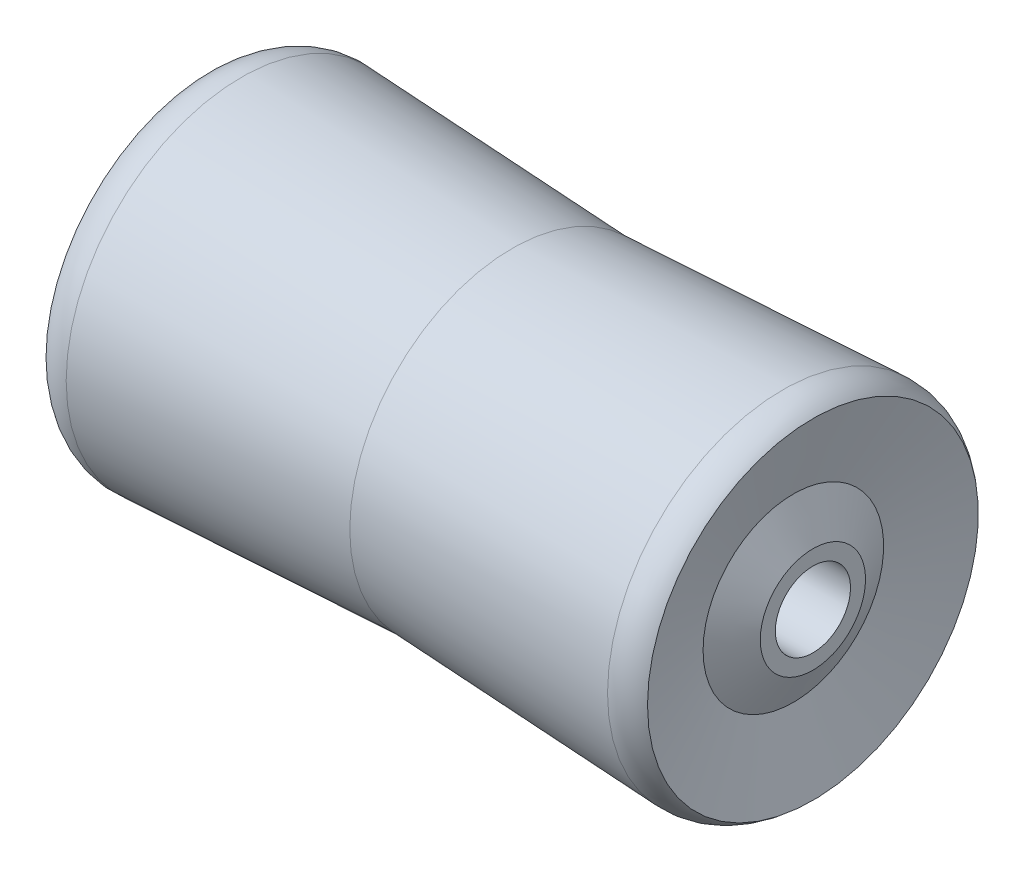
ISO-10303-21;
HEADER;
FILE_DESCRIPTION(('STEP AP214'),'2;1');
FILE_NAME('part.step','',(''),(''),'','','');
FILE_SCHEMA(('AUTOMOTIVE_DESIGN { 1 0 10303 214 1 1 1 1 }'));
ENDSEC;
DATA;
#1=APPLICATION_CONTEXT('core data for automotive mechanical design processes');
#2=APPLICATION_PROTOCOL_DEFINITION('international standard','automotive_design',2000,#1);
#3=PRODUCT_CONTEXT('',#1,'mechanical');
#4=PRODUCT('Part','Part','',(#3));
#5=PRODUCT_RELATED_PRODUCT_CATEGORY('part','',(#4));
#6=PRODUCT_DEFINITION_FORMATION('','',#4);
#7=PRODUCT_DEFINITION_CONTEXT('part definition',#1,'design');
#8=PRODUCT_DEFINITION('design','',#6,#7);
#9=PRODUCT_DEFINITION_SHAPE('','',#8);
#10=(LENGTH_UNIT() NAMED_UNIT(*) SI_UNIT(.MILLI.,.METRE.));
#11=(NAMED_UNIT(*) PLANE_ANGLE_UNIT() SI_UNIT($,.RADIAN.));
#12=(NAMED_UNIT(*) SI_UNIT($,.STERADIAN.) SOLID_ANGLE_UNIT());
#13=UNCERTAINTY_MEASURE_WITH_UNIT(LENGTH_MEASURE(1.E-05),#10,'distance_accuracy_value','');
#14=(GEOMETRIC_REPRESENTATION_CONTEXT(3) GLOBAL_UNCERTAINTY_ASSIGNED_CONTEXT((#13)) GLOBAL_UNIT_ASSIGNED_CONTEXT((#10,
#11,#12)) REPRESENTATION_CONTEXT('',''));
#15=CARTESIAN_POINT('',(0.,0.,0.));
#16=DIRECTION('',(0.,0.,1.));
#17=DIRECTION('',(1.,0.,0.));
#18=AXIS2_PLACEMENT_3D('',#15,#16,#17);
#19=CARTESIAN_POINT('',(-91.2203611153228,0.,0.));
#20=DIRECTION('',(-1.,0.,0.));
#21=DIRECTION('',(0.,0.,1.));
#22=AXIS2_PLACEMENT_3D('',#19,#20,#21);
#23=TOROIDAL_SURFACE('',#22,45.1735637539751,13.1772875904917);
#24=CARTESIAN_POINT('',(-89.9999999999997,0.,0.));
#25=DIRECTION('',(-1.,0.,0.));
#26=DIRECTION('',(0.,0.,1.));
#27=AXIS2_PLACEMENT_3D('',#24,#25,#26);
#28=CIRCLE('',#27,58.2942202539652);
#29=CARTESIAN_POINT('',(-89.9999999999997,0.,58.2942202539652));
#30=VERTEX_POINT('',#29);
#31=EDGE_CURVE('E65',#30,#30,#28,.T.);
#32=ORIENTED_EDGE('',*,*,#31,.T.);
#33=EDGE_LOOP('',(#32));
#34=FACE_BOUND('',#33,.T.);
#35=CARTESIAN_POINT('',(-100.,0.,0.));
#36=DIRECTION('',(-1.,0.,0.));
#37=DIRECTION('',(0.,0.,1.));
#38=AXIS2_PLACEMENT_3D('',#35,#36,#37);
#39=CIRCLE('',#38,55.);
#40=CARTESIAN_POINT('',(-100.,0.,55.));
#41=VERTEX_POINT('',#40);
#42=EDGE_CURVE('E10',#41,#41,#39,.T.);
#43=ORIENTED_EDGE('',*,*,#42,.F.);
#44=EDGE_LOOP('',(#43));
#45=FACE_BOUND('',#44,.T.);
#46=ADVANCED_FACE('F28',(#34,#45),#23,.T.);
#47=CARTESIAN_POINT('',(-100.,0.,0.));
#48=DIRECTION('',(-1.,0.,0.));
#49=DIRECTION('',(0.,0.,1.));
#50=AXIS2_PLACEMENT_3D('',#47,#48,#49);
#51=CONICAL_SURFACE('',#50,55.,1.31623218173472);
#52=CARTESIAN_POINT('',(-93.5,0.,0.));
#53=DIRECTION('',(-1.,0.,0.));
#54=DIRECTION('',(0.,0.,1.));
#55=AXIS2_PLACEMENT_3D('',#52,#53,#54);
#56=CIRCLE('',#55,30.0201138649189);
#57=CARTESIAN_POINT('',(-93.5,0.,30.0201138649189));
#58=VERTEX_POINT('',#57);
#59=EDGE_CURVE('E34',#58,#58,#56,.T.);
#60=ORIENTED_EDGE('',*,*,#59,.F.);
#61=EDGE_LOOP('',(#60));
#62=FACE_BOUND('',#61,.T.);
#63=ORIENTED_EDGE('',*,*,#42,.T.);
#64=EDGE_LOOP('',(#63));
#65=FACE_BOUND('',#64,.T.);
#66=ADVANCED_FACE('F89',(#62,#65),#51,.F.);
#67=CARTESIAN_POINT('',(-100.,0.,0.));
#68=DIRECTION('',(1.,0.,0.));
#69=DIRECTION('',(0.,0.,-1.));
#70=AXIS2_PLACEMENT_3D('',#67,#68,#69);
#71=CONICAL_SURFACE('',#70,17.5,1.09193484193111);
#72=ORIENTED_EDGE('',*,*,#59,.T.);
#73=EDGE_LOOP('',(#72));
#74=FACE_BOUND('',#73,.T.);
#75=CARTESIAN_POINT('',(-100.,0.,0.));
#76=DIRECTION('',(-1.,0.,0.));
#77=DIRECTION('',(0.,0.,1.));
#78=AXIS2_PLACEMENT_3D('',#75,#76,#77);
#79=CIRCLE('',#78,17.5);
#80=CARTESIAN_POINT('',(-100.,0.,17.5));
#81=VERTEX_POINT('',#80);
#82=EDGE_CURVE('E38',#81,#81,#79,.T.);
#83=ORIENTED_EDGE('',*,*,#82,.F.);
#84=EDGE_LOOP('',(#83));
#85=FACE_BOUND('',#84,.T.);
#86=ADVANCED_FACE('F93',(#74,#85),#71,.T.);
#87=CARTESIAN_POINT('',(-100.,-124.315155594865,0.));
#88=DIRECTION('',(-1.,0.,0.));
#89=DIRECTION('',(0.,0.,1.));
#90=AXIS2_PLACEMENT_3D('',#87,#88,#89);
#91=PLANE('',#90);
#92=ORIENTED_EDGE('',*,*,#82,.T.);
#93=EDGE_LOOP('',(#92));
#94=FACE_BOUND('',#93,.T.);
#95=CARTESIAN_POINT('',(-100.,0.,0.));
#96=DIRECTION('',(-1.,0.,0.));
#97=DIRECTION('',(0.,0.,1.));
#98=AXIS2_PLACEMENT_3D('',#95,#96,#97);
#99=CIRCLE('',#98,12.5);
#100=CARTESIAN_POINT('',(-100.,0.,12.5));
#101=VERTEX_POINT('',#100);
#102=EDGE_CURVE('E42',#101,#101,#99,.T.);
#103=ORIENTED_EDGE('',*,*,#102,.F.);
#104=EDGE_LOOP('',(#103));
#105=FACE_BOUND('',#104,.T.);
#106=ADVANCED_FACE('F98',(#94,#105),#91,.T.);
#107=CARTESIAN_POINT('',(-100.,0.,0.));
#108=DIRECTION('',(-1.,0.,0.));
#109=DIRECTION('',(0.,0.,1.));
#110=AXIS2_PLACEMENT_3D('',#107,#108,#109);
#111=CYLINDRICAL_SURFACE('',#110,12.5);
#112=CARTESIAN_POINT('',(100.,0.,0.));
#113=DIRECTION('',(-1.,0.,0.));
#114=DIRECTION('',(0.,0.,1.));
#115=AXIS2_PLACEMENT_3D('',#112,#113,#114);
#116=CIRCLE('',#115,12.5);
#117=CARTESIAN_POINT('',(100.,0.,12.5));
#118=VERTEX_POINT('',#117);
#119=EDGE_CURVE('E47',#118,#118,#116,.T.);
#120=ORIENTED_EDGE('',*,*,#119,.F.);
#121=EDGE_LOOP('',(#120));
#122=FACE_BOUND('',#121,.T.);
#123=ORIENTED_EDGE('',*,*,#102,.T.);
#124=EDGE_LOOP('',(#123));
#125=FACE_BOUND('',#124,.T.);
#126=ADVANCED_FACE('F103',(#122,#125),#111,.F.);
#127=CARTESIAN_POINT('',(100.,-124.315155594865,0.));
#128=DIRECTION('',(-1.,0.,0.));
#129=DIRECTION('',(0.,0.,1.));
#130=AXIS2_PLACEMENT_3D('',#127,#128,#129);
#131=PLANE('',#130);
#132=CARTESIAN_POINT('',(100.,0.,0.));
#133=DIRECTION('',(-1.,0.,0.));
#134=DIRECTION('',(0.,0.,1.));
#135=AXIS2_PLACEMENT_3D('',#132,#133,#134);
#136=CIRCLE('',#135,17.5);
#137=CARTESIAN_POINT('',(100.,0.,17.5));
#138=VERTEX_POINT('',#137);
#139=EDGE_CURVE('E50',#138,#138,#136,.T.);
#140=ORIENTED_EDGE('',*,*,#139,.F.);
#141=EDGE_LOOP('',(#140));
#142=FACE_BOUND('',#141,.T.);
#143=ORIENTED_EDGE('',*,*,#119,.T.);
#144=EDGE_LOOP('',(#143));
#145=FACE_BOUND('',#144,.T.);
#146=ADVANCED_FACE('F107',(#142,#145),#131,.F.);
#147=CARTESIAN_POINT('',(100.,0.,0.));
#148=DIRECTION('',(-1.,0.,0.));
#149=DIRECTION('',(0.,0.,1.));
#150=AXIS2_PLACEMENT_3D('',#147,#148,#149);
#151=CONICAL_SURFACE('',#150,17.5,1.09193484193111);
#152=CARTESIAN_POINT('',(93.5,0.,0.));
#153=DIRECTION('',(-1.,0.,0.));
#154=DIRECTION('',(0.,0.,1.));
#155=AXIS2_PLACEMENT_3D('',#152,#153,#154);
#156=CIRCLE('',#155,30.0201138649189);
#157=CARTESIAN_POINT('',(93.5,0.,30.0201138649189));
#158=VERTEX_POINT('',#157);
#159=EDGE_CURVE('E53',#158,#158,#156,.T.);
#160=ORIENTED_EDGE('',*,*,#159,.F.);
#161=EDGE_LOOP('',(#160));
#162=FACE_BOUND('',#161,.T.);
#163=ORIENTED_EDGE('',*,*,#139,.T.);
#164=EDGE_LOOP('',(#163));
#165=FACE_BOUND('',#164,.T.);
#166=ADVANCED_FACE('F111',(#162,#165),#151,.T.);
#167=CARTESIAN_POINT('',(93.5,0.,0.));
#168=DIRECTION('',(1.,0.,0.));
#169=DIRECTION('',(0.,0.,-1.));
#170=AXIS2_PLACEMENT_3D('',#167,#168,#169);
#171=CONICAL_SURFACE('',#170,30.0201138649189,1.31623218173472);
#172=CARTESIAN_POINT('',(100.,0.,0.));
#173=DIRECTION('',(-1.,0.,0.));
#174=DIRECTION('',(0.,0.,1.));
#175=AXIS2_PLACEMENT_3D('',#172,#173,#174);
#176=CIRCLE('',#175,55.);
#177=CARTESIAN_POINT('',(100.,0.,55.));
#178=VERTEX_POINT('',#177);
#179=EDGE_CURVE('E56',#178,#178,#176,.T.);
#180=ORIENTED_EDGE('',*,*,#179,.F.);
#181=EDGE_LOOP('',(#180));
#182=FACE_BOUND('',#181,.T.);
#183=ORIENTED_EDGE('',*,*,#159,.T.);
#184=EDGE_LOOP('',(#183));
#185=FACE_BOUND('',#184,.T.);
#186=ADVANCED_FACE('F85',(#182,#185),#171,.F.);
#187=CARTESIAN_POINT('',(91.2203611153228,0.,0.));
#188=DIRECTION('',(-1.,0.,0.));
#189=DIRECTION('',(0.,0.,1.));
#190=AXIS2_PLACEMENT_3D('',#187,#188,#189);
#191=TOROIDAL_SURFACE('',#190,45.1735637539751,13.1772875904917);
#192=CARTESIAN_POINT('',(90.,0.,0.));
#193=DIRECTION('',(-1.,0.,0.));
#194=DIRECTION('',(0.,0.,1.));
#195=AXIS2_PLACEMENT_3D('',#192,#193,#194);
#196=CIRCLE('',#195,58.2942202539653);
#197=CARTESIAN_POINT('',(90.,0.,58.2942202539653));
#198=VERTEX_POINT('',#197);
#199=EDGE_CURVE('E59',#198,#198,#196,.T.);
#200=ORIENTED_EDGE('',*,*,#199,.F.);
#201=EDGE_LOOP('',(#200));
#202=FACE_BOUND('',#201,.T.);
#203=ORIENTED_EDGE('',*,*,#179,.T.);
#204=EDGE_LOOP('',(#203));
#205=FACE_BOUND('',#204,.T.);
#206=ADVANCED_FACE('F79',(#202,#205),#191,.T.);
#207=CARTESIAN_POINT('',(-2.61094947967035,0.,0.));
#208=DIRECTION('',(-1.,0.,0.));
#209=DIRECTION('',(0.,0.,1.));
#210=AXIS2_PLACEMENT_3D('',#207,#208,#209);
#211=TOROIDAL_SURFACE('',#210,1053.996591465,999.999999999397);
#212=ORIENTED_EDGE('',*,*,#199,.T.);
#213=EDGE_LOOP('',(#212));
#214=FACE_BOUND('',#213,.T.);
#215=CARTESIAN_POINT('',(3.7470027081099E-13,0.,0.));
#216=DIRECTION('',(-1.,0.,0.));
#217=DIRECTION('',(0.,0.,1.));
#218=AXIS2_PLACEMENT_3D('',#215,#216,#217);
#219=CIRCLE('',#218,54.);
#220=CARTESIAN_POINT('',(3.7470027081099E-13,0.,54.));
#221=VERTEX_POINT('',#220);
#222=EDGE_CURVE('E62',#221,#221,#219,.T.);
#223=ORIENTED_EDGE('',*,*,#222,.F.);
#224=EDGE_LOOP('',(#223));
#225=FACE_BOUND('',#224,.T.);
#226=ADVANCED_FACE('F74',(#214,#225),#211,.F.);
#227=CARTESIAN_POINT('',(2.61094947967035,0.,0.));
#228=DIRECTION('',(-1.,0.,0.));
#229=DIRECTION('',(0.,0.,1.));
#230=AXIS2_PLACEMENT_3D('',#227,#228,#229);
#231=TOROIDAL_SURFACE('',#230,1053.996591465,999.999999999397);
#232=ORIENTED_EDGE('',*,*,#31,.F.);
#233=EDGE_LOOP('',(#232));
#234=FACE_BOUND('',#233,.T.);
#235=ORIENTED_EDGE('',*,*,#222,.T.);
#236=EDGE_LOOP('',(#235));
#237=FACE_BOUND('',#236,.T.);
#238=ADVANCED_FACE('F71',(#234,#237),#231,.F.);
#239=CLOSED_SHELL('',(#46,#66,#86,#106,#126,#146,#166,#186,#206,#226,#238));
#240=MANIFOLD_SOLID_BREP('B2',#239);
#241=ADVANCED_BREP_SHAPE_REPRESENTATION('',(#18,#240),#14);
#242=SHAPE_DEFINITION_REPRESENTATION(#9,#241);
ENDSEC;
END-ISO-10303-21;
